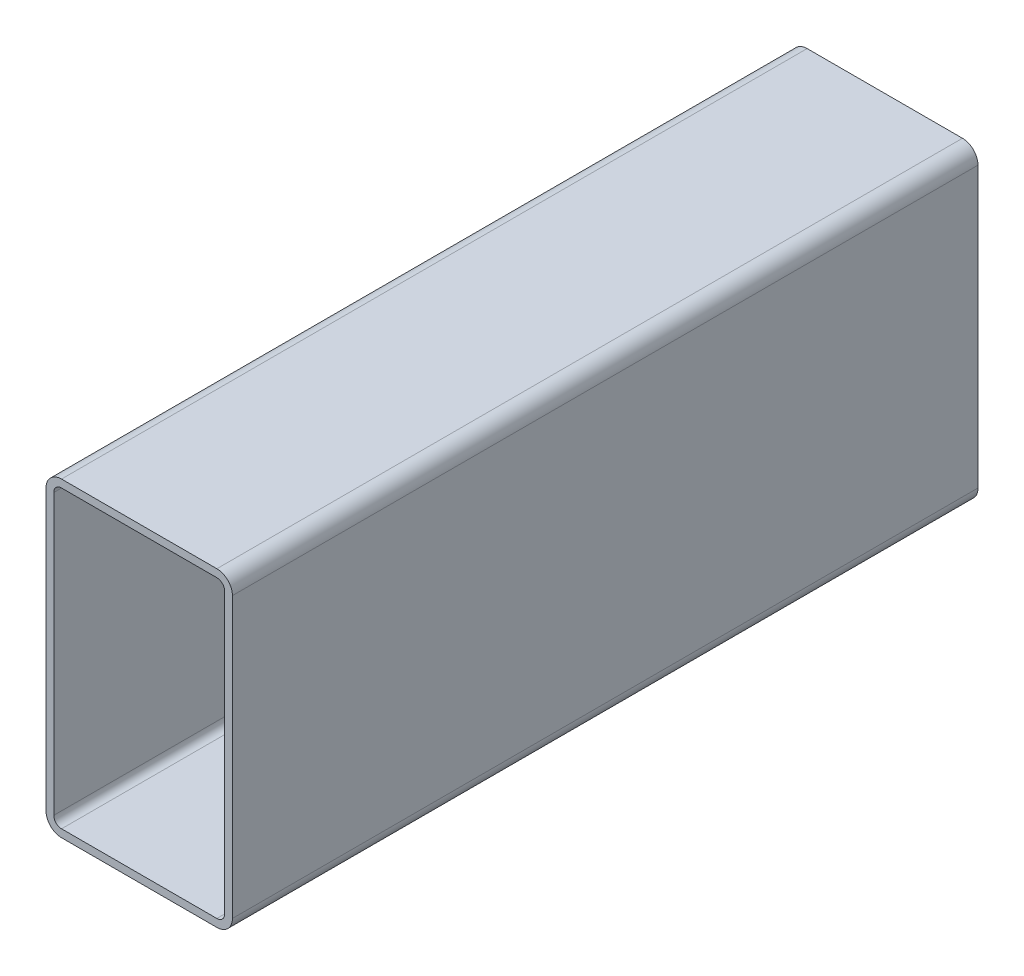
ISO-10303-21;
HEADER;
FILE_DESCRIPTION(('STEP AP214'),'2;1');
FILE_NAME('part.step','',(''),(''),'','','');
FILE_SCHEMA(('AUTOMOTIVE_DESIGN { 1 0 10303 214 1 1 1 1 }'));
ENDSEC;
DATA;
#1=APPLICATION_CONTEXT('core data for automotive mechanical design processes');
#2=APPLICATION_PROTOCOL_DEFINITION('international standard','automotive_design',2000,#1);
#3=PRODUCT_CONTEXT('',#1,'mechanical');
#4=PRODUCT('Part','Part','',(#3));
#5=PRODUCT_RELATED_PRODUCT_CATEGORY('part','',(#4));
#6=PRODUCT_DEFINITION_FORMATION('','',#4);
#7=PRODUCT_DEFINITION_CONTEXT('part definition',#1,'design');
#8=PRODUCT_DEFINITION('design','',#6,#7);
#9=PRODUCT_DEFINITION_SHAPE('','',#8);
#10=(LENGTH_UNIT() NAMED_UNIT(*) SI_UNIT(.MILLI.,.METRE.));
#11=(NAMED_UNIT(*) PLANE_ANGLE_UNIT() SI_UNIT($,.RADIAN.));
#12=(NAMED_UNIT(*) SI_UNIT($,.STERADIAN.) SOLID_ANGLE_UNIT());
#13=UNCERTAINTY_MEASURE_WITH_UNIT(LENGTH_MEASURE(1.E-05),#10,'distance_accuracy_value','');
#14=(GEOMETRIC_REPRESENTATION_CONTEXT(3) GLOBAL_UNCERTAINTY_ASSIGNED_CONTEXT((#13)) GLOBAL_UNIT_ASSIGNED_CONTEXT((#10,
#11,#12)) REPRESENTATION_CONTEXT('',''));
#15=CARTESIAN_POINT('',(0.,0.,0.));
#16=DIRECTION('',(0.,0.,1.));
#17=DIRECTION('',(1.,0.,0.));
#18=AXIS2_PLACEMENT_3D('',#15,#16,#17);
#19=CARTESIAN_POINT('',(8.83911603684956,122.684856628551,304.8));
#20=DIRECTION('',(0.,0.,1.));
#21=DIRECTION('',(1.,0.,0.));
#22=AXIS2_PLACEMENT_3D('',#19,#20,#21);
#23=PLANE('',#22);
#24=CARTESIAN_POINT('',(8.83911603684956,122.684856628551,304.8));
#25=DIRECTION('',(0.,0.,1.));
#26=DIRECTION('',(1.,0.,0.));
#27=AXIS2_PLACEMENT_3D('',#24,#25,#26);
#28=CIRCLE('',#27,6.35000000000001);
#29=CARTESIAN_POINT('',(8.83911603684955,129.034856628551,304.8));
#30=VERTEX_POINT('',#29);
#31=CARTESIAN_POINT('',(2.48911603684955,122.684856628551,304.8));
#32=VERTEX_POINT('',#31);
#33=EDGE_CURVE('E211',#30,#32,#28,.T.);
#34=ORIENTED_EDGE('',*,*,#33,.T.);
#35=DIRECTION('',(0.,-1.,0.));
#36=VECTOR('',#35,1.);
#37=CARTESIAN_POINT('',(2.48911603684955,8.38485662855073,304.8));
#38=LINE('',#37,#36);
#39=CARTESIAN_POINT('',(2.48911603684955,8.38485662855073,304.8));
#40=VERTEX_POINT('',#39);
#41=EDGE_CURVE('E214',#32,#40,#38,.T.);
#42=ORIENTED_EDGE('',*,*,#41,.T.);
#43=CARTESIAN_POINT('',(8.83911603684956,8.38485662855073,304.8));
#44=DIRECTION('',(0.,0.,1.));
#45=DIRECTION('',(1.,0.,0.));
#46=AXIS2_PLACEMENT_3D('',#43,#44,#45);
#47=CIRCLE('',#46,6.35);
#48=CARTESIAN_POINT('',(8.83911603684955,2.03485662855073,304.8));
#49=VERTEX_POINT('',#48);
#50=EDGE_CURVE('E217',#40,#49,#47,.T.);
#51=ORIENTED_EDGE('',*,*,#50,.T.);
#52=DIRECTION('',(1.,0.,0.));
#53=VECTOR('',#52,1.);
#54=CARTESIAN_POINT('',(72.3391160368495,2.03485662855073,304.8));
#55=LINE('',#54,#53);
#56=CARTESIAN_POINT('',(72.3391160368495,2.03485662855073,304.8));
#57=VERTEX_POINT('',#56);
#58=EDGE_CURVE('E219',#49,#57,#55,.T.);
#59=ORIENTED_EDGE('',*,*,#58,.T.);
#60=CARTESIAN_POINT('',(72.3391160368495,8.38485662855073,304.8));
#61=DIRECTION('',(0.,0.,1.));
#62=DIRECTION('',(1.,0.,0.));
#63=AXIS2_PLACEMENT_3D('',#60,#61,#62);
#64=CIRCLE('',#63,6.35);
#65=CARTESIAN_POINT('',(78.6891160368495,8.38485662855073,304.8));
#66=VERTEX_POINT('',#65);
#67=EDGE_CURVE('E221',#57,#66,#64,.T.);
#68=ORIENTED_EDGE('',*,*,#67,.T.);
#69=DIRECTION('',(0.,1.,0.));
#70=VECTOR('',#69,1.);
#71=CARTESIAN_POINT('',(78.6891160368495,122.684856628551,304.8));
#72=LINE('',#71,#70);
#73=CARTESIAN_POINT('',(78.6891160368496,122.684856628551,304.8));
#74=VERTEX_POINT('',#73);
#75=EDGE_CURVE('E223',#66,#74,#72,.T.);
#76=ORIENTED_EDGE('',*,*,#75,.T.);
#77=CARTESIAN_POINT('',(72.3391160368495,122.684856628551,304.8));
#78=DIRECTION('',(0.,0.,1.));
#79=DIRECTION('',(1.,0.,0.));
#80=AXIS2_PLACEMENT_3D('',#77,#78,#79);
#81=CIRCLE('',#80,6.35000000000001);
#82=CARTESIAN_POINT('',(72.3391160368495,129.034856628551,304.8));
#83=VERTEX_POINT('',#82);
#84=EDGE_CURVE('E225',#74,#83,#81,.T.);
#85=ORIENTED_EDGE('',*,*,#84,.T.);
#86=DIRECTION('',(-1.,0.,0.));
#87=VECTOR('',#86,1.);
#88=CARTESIAN_POINT('',(8.83911603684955,129.034856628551,304.8));
#89=LINE('',#88,#87);
#90=EDGE_CURVE('E227',#83,#30,#89,.T.);
#91=ORIENTED_EDGE('',*,*,#90,.T.);
#92=EDGE_LOOP('',(#34,#42,#51,#59,#68,#76,#85,#91));
#93=FACE_BOUND('',#92,.T.);
#94=DIRECTION('',(0.,-1.,0.));
#95=VECTOR('',#94,1.);
#96=CARTESIAN_POINT('',(5.66411603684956,8.38485662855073,304.8));
#97=LINE('',#96,#95);
#98=CARTESIAN_POINT('',(5.66411603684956,122.684856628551,304.8));
#99=VERTEX_POINT('',#98);
#100=CARTESIAN_POINT('',(5.66411603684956,8.38485662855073,304.8));
#101=VERTEX_POINT('',#100);
#102=EDGE_CURVE('E154',#99,#101,#97,.T.);
#103=ORIENTED_EDGE('',*,*,#102,.F.);
#104=CARTESIAN_POINT('',(8.83911603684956,122.684856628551,304.8));
#105=DIRECTION('',(0.,0.,1.));
#106=DIRECTION('',(1.,0.,0.));
#107=AXIS2_PLACEMENT_3D('',#104,#105,#106);
#108=CIRCLE('',#107,3.17500000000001);
#109=CARTESIAN_POINT('',(8.83911603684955,125.859856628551,304.8));
#110=VERTEX_POINT('',#109);
#111=EDGE_CURVE('E146',#110,#99,#108,.T.);
#112=ORIENTED_EDGE('',*,*,#111,.F.);
#113=DIRECTION('',(-1.,0.,0.));
#114=VECTOR('',#113,1.);
#115=CARTESIAN_POINT('',(8.83911603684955,125.859856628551,304.8));
#116=LINE('',#115,#114);
#117=CARTESIAN_POINT('',(72.3391160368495,125.859856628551,304.8));
#118=VERTEX_POINT('',#117);
#119=EDGE_CURVE('E179',#118,#110,#116,.T.);
#120=ORIENTED_EDGE('',*,*,#119,.F.);
#121=CARTESIAN_POINT('',(72.3391160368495,122.684856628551,304.8));
#122=DIRECTION('',(0.,0.,1.));
#123=DIRECTION('',(1.,0.,0.));
#124=AXIS2_PLACEMENT_3D('',#121,#122,#123);
#125=CIRCLE('',#124,3.17500000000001);
#126=CARTESIAN_POINT('',(75.5141160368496,122.684856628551,304.8));
#127=VERTEX_POINT('',#126);
#128=EDGE_CURVE('E177',#127,#118,#125,.T.);
#129=ORIENTED_EDGE('',*,*,#128,.F.);
#130=DIRECTION('',(0.,1.,0.));
#131=VECTOR('',#130,1.);
#132=CARTESIAN_POINT('',(75.5141160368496,122.684856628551,304.8));
#133=LINE('',#132,#131);
#134=CARTESIAN_POINT('',(75.5141160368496,8.38485662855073,304.8));
#135=VERTEX_POINT('',#134);
#136=EDGE_CURVE('E175',#135,#127,#133,.T.);
#137=ORIENTED_EDGE('',*,*,#136,.F.);
#138=CARTESIAN_POINT('',(72.3391160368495,8.38485662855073,304.8));
#139=DIRECTION('',(0.,0.,1.));
#140=DIRECTION('',(1.,0.,0.));
#141=AXIS2_PLACEMENT_3D('',#138,#139,#140);
#142=CIRCLE('',#141,3.175);
#143=CARTESIAN_POINT('',(72.3391160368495,5.20985662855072,304.8));
#144=VERTEX_POINT('',#143);
#145=EDGE_CURVE('E173',#144,#135,#142,.T.);
#146=ORIENTED_EDGE('',*,*,#145,.F.);
#147=DIRECTION('',(1.,0.,0.));
#148=VECTOR('',#147,1.);
#149=CARTESIAN_POINT('',(72.3391160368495,5.20985662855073,304.8));
#150=LINE('',#149,#148);
#151=CARTESIAN_POINT('',(8.83911603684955,5.20985662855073,304.8));
#152=VERTEX_POINT('',#151);
#153=EDGE_CURVE('E169',#152,#144,#150,.T.);
#154=ORIENTED_EDGE('',*,*,#153,.F.);
#155=CARTESIAN_POINT('',(8.83911603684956,8.38485662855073,304.8));
#156=DIRECTION('',(0.,0.,1.));
#157=DIRECTION('',(1.,0.,0.));
#158=AXIS2_PLACEMENT_3D('',#155,#156,#157);
#159=CIRCLE('',#158,3.175);
#160=EDGE_CURVE('E167',#101,#152,#159,.T.);
#161=ORIENTED_EDGE('',*,*,#160,.F.);
#162=EDGE_LOOP('',(#103,#112,#120,#129,#137,#146,#154,#161));
#163=FACE_BOUND('',#162,.T.);
#164=ADVANCED_FACE('F33',(#93,#163),#23,.T.);
#165=CARTESIAN_POINT('',(8.83911603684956,122.684856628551,0.));
#166=DIRECTION('',(0.,0.,1.));
#167=DIRECTION('',(1.,0.,0.));
#168=AXIS2_PLACEMENT_3D('',#165,#166,#167);
#169=PLANE('',#168);
#170=CARTESIAN_POINT('',(8.83911603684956,122.684856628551,0.));
#171=DIRECTION('',(0.,0.,1.));
#172=DIRECTION('',(1.,0.,0.));
#173=AXIS2_PLACEMENT_3D('',#170,#171,#172);
#174=CIRCLE('',#173,6.35000000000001);
#175=CARTESIAN_POINT('',(8.83911603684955,129.034856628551,0.));
#176=VERTEX_POINT('',#175);
#177=CARTESIAN_POINT('',(2.48911603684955,122.684856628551,0.));
#178=VERTEX_POINT('',#177);
#179=EDGE_CURVE('E162',#176,#178,#174,.T.);
#180=ORIENTED_EDGE('',*,*,#179,.F.);
#181=DIRECTION('',(-1.,0.,0.));
#182=VECTOR('',#181,1.);
#183=CARTESIAN_POINT('',(8.83911603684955,129.034856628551,0.));
#184=LINE('',#183,#182);
#185=CARTESIAN_POINT('',(72.3391160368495,129.034856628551,0.));
#186=VERTEX_POINT('',#185);
#187=EDGE_CURVE('E215',#186,#176,#184,.T.);
#188=ORIENTED_EDGE('',*,*,#187,.F.);
#189=CARTESIAN_POINT('',(72.3391160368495,122.684856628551,0.));
#190=DIRECTION('',(0.,0.,1.));
#191=DIRECTION('',(1.,0.,0.));
#192=AXIS2_PLACEMENT_3D('',#189,#190,#191);
#193=CIRCLE('',#192,6.35000000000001);
#194=CARTESIAN_POINT('',(78.6891160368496,122.684856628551,0.));
#195=VERTEX_POINT('',#194);
#196=EDGE_CURVE('E242',#195,#186,#193,.T.);
#197=ORIENTED_EDGE('',*,*,#196,.F.);
#198=DIRECTION('',(0.,1.,0.));
#199=VECTOR('',#198,1.);
#200=CARTESIAN_POINT('',(78.6891160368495,122.684856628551,0.));
#201=LINE('',#200,#199);
#202=CARTESIAN_POINT('',(78.6891160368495,8.38485662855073,0.));
#203=VERTEX_POINT('',#202);
#204=EDGE_CURVE('E240',#203,#195,#201,.T.);
#205=ORIENTED_EDGE('',*,*,#204,.F.);
#206=CARTESIAN_POINT('',(72.3391160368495,8.38485662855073,0.));
#207=DIRECTION('',(0.,0.,1.));
#208=DIRECTION('',(1.,0.,0.));
#209=AXIS2_PLACEMENT_3D('',#206,#207,#208);
#210=CIRCLE('',#209,6.35);
#211=CARTESIAN_POINT('',(72.3391160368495,2.03485662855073,0.));
#212=VERTEX_POINT('',#211);
#213=EDGE_CURVE('E238',#212,#203,#210,.T.);
#214=ORIENTED_EDGE('',*,*,#213,.F.);
#215=DIRECTION('',(1.,0.,0.));
#216=VECTOR('',#215,1.);
#217=CARTESIAN_POINT('',(72.3391160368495,2.03485662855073,0.));
#218=LINE('',#217,#216);
#219=CARTESIAN_POINT('',(8.83911603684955,2.03485662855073,0.));
#220=VERTEX_POINT('',#219);
#221=EDGE_CURVE('E236',#220,#212,#218,.T.);
#222=ORIENTED_EDGE('',*,*,#221,.F.);
#223=CARTESIAN_POINT('',(8.83911603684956,8.38485662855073,0.));
#224=DIRECTION('',(0.,0.,1.));
#225=DIRECTION('',(1.,0.,0.));
#226=AXIS2_PLACEMENT_3D('',#223,#224,#225);
#227=CIRCLE('',#226,6.35);
#228=CARTESIAN_POINT('',(2.48911603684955,8.38485662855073,0.));
#229=VERTEX_POINT('',#228);
#230=EDGE_CURVE('E234',#229,#220,#227,.T.);
#231=ORIENTED_EDGE('',*,*,#230,.F.);
#232=DIRECTION('',(0.,-1.,0.));
#233=VECTOR('',#232,1.);
#234=CARTESIAN_POINT('',(2.48911603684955,8.38485662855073,0.));
#235=LINE('',#234,#233);
#236=EDGE_CURVE('E232',#178,#229,#235,.T.);
#237=ORIENTED_EDGE('',*,*,#236,.F.);
#238=EDGE_LOOP('',(#180,#188,#197,#205,#214,#222,#231,#237));
#239=FACE_BOUND('',#238,.T.);
#240=CARTESIAN_POINT('',(8.83911603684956,122.684856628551,0.));
#241=DIRECTION('',(0.,0.,1.));
#242=DIRECTION('',(1.,0.,0.));
#243=AXIS2_PLACEMENT_3D('',#240,#241,#242);
#244=CIRCLE('',#243,3.17500000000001);
#245=CARTESIAN_POINT('',(8.83911603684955,125.859856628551,0.));
#246=VERTEX_POINT('',#245);
#247=CARTESIAN_POINT('',(5.66411603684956,122.684856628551,0.));
#248=VERTEX_POINT('',#247);
#249=EDGE_CURVE('E56',#246,#248,#244,.T.);
#250=ORIENTED_EDGE('',*,*,#249,.T.);
#251=DIRECTION('',(0.,-1.,0.));
#252=VECTOR('',#251,1.);
#253=CARTESIAN_POINT('',(5.66411603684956,8.38485662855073,0.));
#254=LINE('',#253,#252);
#255=CARTESIAN_POINT('',(5.66411603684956,8.38485662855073,0.));
#256=VERTEX_POINT('',#255);
#257=EDGE_CURVE('E161',#248,#256,#254,.T.);
#258=ORIENTED_EDGE('',*,*,#257,.T.);
#259=CARTESIAN_POINT('',(8.83911603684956,8.38485662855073,0.));
#260=DIRECTION('',(0.,0.,1.));
#261=DIRECTION('',(1.,0.,0.));
#262=AXIS2_PLACEMENT_3D('',#259,#260,#261);
#263=CIRCLE('',#262,3.175);
#264=CARTESIAN_POINT('',(8.83911603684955,5.20985662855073,0.));
#265=VERTEX_POINT('',#264);
#266=EDGE_CURVE('E183',#256,#265,#263,.T.);
#267=ORIENTED_EDGE('',*,*,#266,.T.);
#268=DIRECTION('',(1.,0.,0.));
#269=VECTOR('',#268,1.);
#270=CARTESIAN_POINT('',(72.3391160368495,5.20985662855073,0.));
#271=LINE('',#270,#269);
#272=CARTESIAN_POINT('',(72.3391160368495,5.20985662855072,0.));
#273=VERTEX_POINT('',#272);
#274=EDGE_CURVE('E186',#265,#273,#271,.T.);
#275=ORIENTED_EDGE('',*,*,#274,.T.);
#276=CARTESIAN_POINT('',(72.3391160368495,8.38485662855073,0.));
#277=DIRECTION('',(0.,0.,1.));
#278=DIRECTION('',(1.,0.,0.));
#279=AXIS2_PLACEMENT_3D('',#276,#277,#278);
#280=CIRCLE('',#279,3.175);
#281=CARTESIAN_POINT('',(75.5141160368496,8.38485662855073,0.));
#282=VERTEX_POINT('',#281);
#283=EDGE_CURVE('E189',#273,#282,#280,.T.);
#284=ORIENTED_EDGE('',*,*,#283,.T.);
#285=DIRECTION('',(0.,1.,0.));
#286=VECTOR('',#285,1.);
#287=CARTESIAN_POINT('',(75.5141160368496,122.684856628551,0.));
#288=LINE('',#287,#286);
#289=CARTESIAN_POINT('',(75.5141160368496,122.684856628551,0.));
#290=VERTEX_POINT('',#289);
#291=EDGE_CURVE('E192',#282,#290,#288,.T.);
#292=ORIENTED_EDGE('',*,*,#291,.T.);
#293=CARTESIAN_POINT('',(72.3391160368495,122.684856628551,0.));
#294=DIRECTION('',(0.,0.,1.));
#295=DIRECTION('',(1.,0.,0.));
#296=AXIS2_PLACEMENT_3D('',#293,#294,#295);
#297=CIRCLE('',#296,3.17500000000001);
#298=CARTESIAN_POINT('',(72.3391160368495,125.859856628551,0.));
#299=VERTEX_POINT('',#298);
#300=EDGE_CURVE('E195',#290,#299,#297,.T.);
#301=ORIENTED_EDGE('',*,*,#300,.T.);
#302=DIRECTION('',(-1.,0.,0.));
#303=VECTOR('',#302,1.);
#304=CARTESIAN_POINT('',(8.83911603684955,125.859856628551,0.));
#305=LINE('',#304,#303);
#306=EDGE_CURVE('E155',#299,#246,#305,.T.);
#307=ORIENTED_EDGE('',*,*,#306,.T.);
#308=EDGE_LOOP('',(#250,#258,#267,#275,#284,#292,#301,#307));
#309=FACE_BOUND('',#308,.T.);
#310=ADVANCED_FACE('F272',(#239,#309),#169,.F.);
#311=CARTESIAN_POINT('',(8.83911603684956,122.684856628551,304.8));
#312=DIRECTION('',(0.,0.,-1.));
#313=DIRECTION('',(-1.,0.,0.));
#314=AXIS2_PLACEMENT_3D('',#311,#312,#313);
#315=CYLINDRICAL_SURFACE('',#314,6.35000000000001);
#316=ORIENTED_EDGE('',*,*,#179,.T.);
#317=DIRECTION('',(0.,0.,-1.));
#318=VECTOR('',#317,1.);
#319=CARTESIAN_POINT('',(2.48911603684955,122.684856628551,304.8));
#320=LINE('',#319,#318);
#321=EDGE_CURVE('E11',#32,#178,#320,.T.);
#322=ORIENTED_EDGE('',*,*,#321,.F.);
#323=ORIENTED_EDGE('',*,*,#33,.F.);
#324=DIRECTION('',(0.,0.,-1.));
#325=VECTOR('',#324,1.);
#326=CARTESIAN_POINT('',(8.83911603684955,129.034856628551,304.8));
#327=LINE('',#326,#325);
#328=EDGE_CURVE('E229',#30,#176,#327,.T.);
#329=ORIENTED_EDGE('',*,*,#328,.T.);
#330=EDGE_LOOP('',(#316,#322,#323,#329));
#331=FACE_BOUND('',#330,.T.);
#332=ADVANCED_FACE('F35',(#331),#315,.T.);
#333=CARTESIAN_POINT('',(2.48911603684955,8.38485662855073,304.8));
#334=DIRECTION('',(1.,0.,0.));
#335=DIRECTION('',(0.,0.,-1.));
#336=AXIS2_PLACEMENT_3D('',#333,#334,#335);
#337=PLANE('',#336);
#338=ORIENTED_EDGE('',*,*,#236,.T.);
#339=DIRECTION('',(0.,0.,-1.));
#340=VECTOR('',#339,1.);
#341=CARTESIAN_POINT('',(2.48911603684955,8.38485662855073,304.8));
#342=LINE('',#341,#340);
#343=EDGE_CURVE('E41',#40,#229,#342,.T.);
#344=ORIENTED_EDGE('',*,*,#343,.F.);
#345=ORIENTED_EDGE('',*,*,#41,.F.);
#346=ORIENTED_EDGE('',*,*,#321,.T.);
#347=EDGE_LOOP('',(#338,#344,#345,#346));
#348=FACE_BOUND('',#347,.T.);
#349=ADVANCED_FACE('F289',(#348),#337,.F.);
#350=CARTESIAN_POINT('',(8.83911603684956,8.38485662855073,304.8));
#351=DIRECTION('',(0.,0.,-1.));
#352=DIRECTION('',(-1.,0.,0.));
#353=AXIS2_PLACEMENT_3D('',#350,#351,#352);
#354=CYLINDRICAL_SURFACE('',#353,6.35);
#355=ORIENTED_EDGE('',*,*,#230,.T.);
#356=DIRECTION('',(0.,0.,-1.));
#357=VECTOR('',#356,1.);
#358=CARTESIAN_POINT('',(8.83911603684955,2.03485662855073,304.8));
#359=LINE('',#358,#357);
#360=EDGE_CURVE('E259',#49,#220,#359,.T.);
#361=ORIENTED_EDGE('',*,*,#360,.F.);
#362=ORIENTED_EDGE('',*,*,#50,.F.);
#363=ORIENTED_EDGE('',*,*,#343,.T.);
#364=EDGE_LOOP('',(#355,#361,#362,#363));
#365=FACE_BOUND('',#364,.T.);
#366=ADVANCED_FACE('F266',(#365),#354,.T.);
#367=CARTESIAN_POINT('',(72.3391160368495,2.03485662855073,304.8));
#368=DIRECTION('',(0.,1.,0.));
#369=DIRECTION('',(0.,0.,1.));
#370=AXIS2_PLACEMENT_3D('',#367,#368,#369);
#371=PLANE('',#370);
#372=ORIENTED_EDGE('',*,*,#221,.T.);
#373=DIRECTION('',(0.,0.,-1.));
#374=VECTOR('',#373,1.);
#375=CARTESIAN_POINT('',(72.3391160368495,2.03485662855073,304.8));
#376=LINE('',#375,#374);
#377=EDGE_CURVE('E256',#57,#212,#376,.T.);
#378=ORIENTED_EDGE('',*,*,#377,.F.);
#379=ORIENTED_EDGE('',*,*,#58,.F.);
#380=ORIENTED_EDGE('',*,*,#360,.T.);
#381=EDGE_LOOP('',(#372,#378,#379,#380));
#382=FACE_BOUND('',#381,.T.);
#383=ADVANCED_FACE('F278',(#382),#371,.F.);
#384=CARTESIAN_POINT('',(72.3391160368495,8.38485662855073,304.8));
#385=DIRECTION('',(0.,0.,-1.));
#386=DIRECTION('',(-1.,0.,0.));
#387=AXIS2_PLACEMENT_3D('',#384,#385,#386);
#388=CYLINDRICAL_SURFACE('',#387,6.35);
#389=ORIENTED_EDGE('',*,*,#213,.T.);
#390=DIRECTION('',(0.,0.,-1.));
#391=VECTOR('',#390,1.);
#392=CARTESIAN_POINT('',(78.6891160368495,8.38485662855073,304.8));
#393=LINE('',#392,#391);
#394=EDGE_CURVE('E253',#66,#203,#393,.T.);
#395=ORIENTED_EDGE('',*,*,#394,.F.);
#396=ORIENTED_EDGE('',*,*,#67,.F.);
#397=ORIENTED_EDGE('',*,*,#377,.T.);
#398=EDGE_LOOP('',(#389,#395,#396,#397));
#399=FACE_BOUND('',#398,.T.);
#400=ADVANCED_FACE('F282',(#399),#388,.T.);
#401=CARTESIAN_POINT('',(78.6891160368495,122.684856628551,304.8));
#402=DIRECTION('',(-1.,0.,0.));
#403=DIRECTION('',(0.,0.,1.));
#404=AXIS2_PLACEMENT_3D('',#401,#402,#403);
#405=PLANE('',#404);
#406=ORIENTED_EDGE('',*,*,#204,.T.);
#407=DIRECTION('',(0.,0.,-1.));
#408=VECTOR('',#407,1.);
#409=CARTESIAN_POINT('',(78.6891160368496,122.684856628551,304.8));
#410=LINE('',#409,#408);
#411=EDGE_CURVE('E250',#74,#195,#410,.T.);
#412=ORIENTED_EDGE('',*,*,#411,.F.);
#413=ORIENTED_EDGE('',*,*,#75,.F.);
#414=ORIENTED_EDGE('',*,*,#394,.T.);
#415=EDGE_LOOP('',(#406,#412,#413,#414));
#416=FACE_BOUND('',#415,.T.);
#417=ADVANCED_FACE('F302',(#416),#405,.F.);
#418=CARTESIAN_POINT('',(72.3391160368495,122.684856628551,304.8));
#419=DIRECTION('',(0.,0.,-1.));
#420=DIRECTION('',(-1.,0.,0.));
#421=AXIS2_PLACEMENT_3D('',#418,#419,#420);
#422=CYLINDRICAL_SURFACE('',#421,6.35000000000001);
#423=ORIENTED_EDGE('',*,*,#196,.T.);
#424=DIRECTION('',(0.,0.,-1.));
#425=VECTOR('',#424,1.);
#426=CARTESIAN_POINT('',(72.3391160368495,129.034856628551,304.8));
#427=LINE('',#426,#425);
#428=EDGE_CURVE('E247',#83,#186,#427,.T.);
#429=ORIENTED_EDGE('',*,*,#428,.F.);
#430=ORIENTED_EDGE('',*,*,#84,.F.);
#431=ORIENTED_EDGE('',*,*,#411,.T.);
#432=EDGE_LOOP('',(#423,#429,#430,#431));
#433=FACE_BOUND('',#432,.T.);
#434=ADVANCED_FACE('F300',(#433),#422,.T.);
#435=CARTESIAN_POINT('',(8.83911603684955,129.034856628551,304.8));
#436=DIRECTION('',(0.,-1.,0.));
#437=DIRECTION('',(0.,0.,-1.));
#438=AXIS2_PLACEMENT_3D('',#435,#436,#437);
#439=PLANE('',#438);
#440=ORIENTED_EDGE('',*,*,#187,.T.);
#441=ORIENTED_EDGE('',*,*,#328,.F.);
#442=ORIENTED_EDGE('',*,*,#90,.F.);
#443=ORIENTED_EDGE('',*,*,#428,.T.);
#444=EDGE_LOOP('',(#440,#441,#442,#443));
#445=FACE_BOUND('',#444,.T.);
#446=ADVANCED_FACE('F295',(#445),#439,.F.);
#447=CARTESIAN_POINT('',(8.83911603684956,122.684856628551,304.8));
#448=DIRECTION('',(0.,0.,-1.));
#449=DIRECTION('',(-1.,0.,0.));
#450=AXIS2_PLACEMENT_3D('',#447,#448,#449);
#451=CYLINDRICAL_SURFACE('',#450,3.17500000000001);
#452=ORIENTED_EDGE('',*,*,#249,.F.);
#453=DIRECTION('',(0.,0.,-1.));
#454=VECTOR('',#453,1.);
#455=CARTESIAN_POINT('',(8.83911603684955,125.859856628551,304.8));
#456=LINE('',#455,#454);
#457=EDGE_CURVE('E150',#110,#246,#456,.T.);
#458=ORIENTED_EDGE('',*,*,#457,.F.);
#459=ORIENTED_EDGE('',*,*,#111,.T.);
#460=DIRECTION('',(0.,0.,-1.));
#461=VECTOR('',#460,1.);
#462=CARTESIAN_POINT('',(5.66411603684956,122.684856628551,304.8));
#463=LINE('',#462,#461);
#464=EDGE_CURVE('E149',#99,#248,#463,.T.);
#465=ORIENTED_EDGE('',*,*,#464,.T.);
#466=EDGE_LOOP('',(#452,#458,#459,#465));
#467=FACE_BOUND('',#466,.T.);
#468=ADVANCED_FACE('F148',(#467),#451,.F.);
#469=CARTESIAN_POINT('',(5.66411603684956,8.38485662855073,304.8));
#470=DIRECTION('',(1.,0.,0.));
#471=DIRECTION('',(0.,0.,-1.));
#472=AXIS2_PLACEMENT_3D('',#469,#470,#471);
#473=PLANE('',#472);
#474=ORIENTED_EDGE('',*,*,#257,.F.);
#475=ORIENTED_EDGE('',*,*,#464,.F.);
#476=ORIENTED_EDGE('',*,*,#102,.T.);
#477=DIRECTION('',(0.,0.,-1.));
#478=VECTOR('',#477,1.);
#479=CARTESIAN_POINT('',(5.66411603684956,8.38485662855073,304.8));
#480=LINE('',#479,#478);
#481=EDGE_CURVE('E163',#101,#256,#480,.T.);
#482=ORIENTED_EDGE('',*,*,#481,.T.);
#483=EDGE_LOOP('',(#474,#475,#476,#482));
#484=FACE_BOUND('',#483,.T.);
#485=ADVANCED_FACE('F158',(#484),#473,.T.);
#486=CARTESIAN_POINT('',(8.83911603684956,8.38485662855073,304.8));
#487=DIRECTION('',(0.,0.,-1.));
#488=DIRECTION('',(-1.,0.,0.));
#489=AXIS2_PLACEMENT_3D('',#486,#487,#488);
#490=CYLINDRICAL_SURFACE('',#489,3.175);
#491=ORIENTED_EDGE('',*,*,#266,.F.);
#492=ORIENTED_EDGE('',*,*,#481,.F.);
#493=ORIENTED_EDGE('',*,*,#160,.T.);
#494=DIRECTION('',(0.,0.,-1.));
#495=VECTOR('',#494,1.);
#496=CARTESIAN_POINT('',(8.83911603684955,5.20985662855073,304.8));
#497=LINE('',#496,#495);
#498=EDGE_CURVE('E208',#152,#265,#497,.T.);
#499=ORIENTED_EDGE('',*,*,#498,.T.);
#500=EDGE_LOOP('',(#491,#492,#493,#499));
#501=FACE_BOUND('',#500,.T.);
#502=ADVANCED_FACE('F327',(#501),#490,.F.);
#503=CARTESIAN_POINT('',(72.3391160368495,5.20985662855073,304.8));
#504=DIRECTION('',(0.,1.,0.));
#505=DIRECTION('',(0.,0.,1.));
#506=AXIS2_PLACEMENT_3D('',#503,#504,#505);
#507=PLANE('',#506);
#508=ORIENTED_EDGE('',*,*,#274,.F.);
#509=ORIENTED_EDGE('',*,*,#498,.F.);
#510=ORIENTED_EDGE('',*,*,#153,.T.);
#511=DIRECTION('',(0.,0.,-1.));
#512=VECTOR('',#511,1.);
#513=CARTESIAN_POINT('',(72.3391160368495,5.20985662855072,304.8));
#514=LINE('',#513,#512);
#515=EDGE_CURVE('E206',#144,#273,#514,.T.);
#516=ORIENTED_EDGE('',*,*,#515,.T.);
#517=EDGE_LOOP('',(#508,#509,#510,#516));
#518=FACE_BOUND('',#517,.T.);
#519=ADVANCED_FACE('F331',(#518),#507,.T.);
#520=CARTESIAN_POINT('',(72.3391160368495,8.38485662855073,304.8));
#521=DIRECTION('',(0.,0.,-1.));
#522=DIRECTION('',(-1.,0.,0.));
#523=AXIS2_PLACEMENT_3D('',#520,#521,#522);
#524=CYLINDRICAL_SURFACE('',#523,3.175);
#525=ORIENTED_EDGE('',*,*,#283,.F.);
#526=ORIENTED_EDGE('',*,*,#515,.F.);
#527=ORIENTED_EDGE('',*,*,#145,.T.);
#528=DIRECTION('',(0.,0.,-1.));
#529=VECTOR('',#528,1.);
#530=CARTESIAN_POINT('',(75.5141160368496,8.38485662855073,304.8));
#531=LINE('',#530,#529);
#532=EDGE_CURVE('E204',#135,#282,#531,.T.);
#533=ORIENTED_EDGE('',*,*,#532,.T.);
#534=EDGE_LOOP('',(#525,#526,#527,#533));
#535=FACE_BOUND('',#534,.T.);
#536=ADVANCED_FACE('F337',(#535),#524,.F.);
#537=CARTESIAN_POINT('',(75.5141160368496,122.684856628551,304.8));
#538=DIRECTION('',(-1.,0.,0.));
#539=DIRECTION('',(0.,0.,1.));
#540=AXIS2_PLACEMENT_3D('',#537,#538,#539);
#541=PLANE('',#540);
#542=ORIENTED_EDGE('',*,*,#291,.F.);
#543=ORIENTED_EDGE('',*,*,#532,.F.);
#544=ORIENTED_EDGE('',*,*,#136,.T.);
#545=DIRECTION('',(0.,0.,-1.));
#546=VECTOR('',#545,1.);
#547=CARTESIAN_POINT('',(75.5141160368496,122.684856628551,304.8));
#548=LINE('',#547,#546);
#549=EDGE_CURVE('E202',#127,#290,#548,.T.);
#550=ORIENTED_EDGE('',*,*,#549,.T.);
#551=EDGE_LOOP('',(#542,#543,#544,#550));
#552=FACE_BOUND('',#551,.T.);
#553=ADVANCED_FACE('F341',(#552),#541,.T.);
#554=CARTESIAN_POINT('',(72.3391160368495,122.684856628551,304.8));
#555=DIRECTION('',(0.,0.,-1.));
#556=DIRECTION('',(-1.,0.,0.));
#557=AXIS2_PLACEMENT_3D('',#554,#555,#556);
#558=CYLINDRICAL_SURFACE('',#557,3.17500000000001);
#559=ORIENTED_EDGE('',*,*,#300,.F.);
#560=ORIENTED_EDGE('',*,*,#549,.F.);
#561=ORIENTED_EDGE('',*,*,#128,.T.);
#562=DIRECTION('',(0.,0.,-1.));
#563=VECTOR('',#562,1.);
#564=CARTESIAN_POINT('',(72.3391160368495,125.859856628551,304.8));
#565=LINE('',#564,#563);
#566=EDGE_CURVE('E48',#118,#299,#565,.T.);
#567=ORIENTED_EDGE('',*,*,#566,.T.);
#568=EDGE_LOOP('',(#559,#560,#561,#567));
#569=FACE_BOUND('',#568,.T.);
#570=ADVANCED_FACE('F345',(#569),#558,.F.);
#571=CARTESIAN_POINT('',(8.83911603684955,125.859856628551,304.8));
#572=DIRECTION('',(0.,-1.,0.));
#573=DIRECTION('',(0.,0.,-1.));
#574=AXIS2_PLACEMENT_3D('',#571,#572,#573);
#575=PLANE('',#574);
#576=ORIENTED_EDGE('',*,*,#306,.F.);
#577=ORIENTED_EDGE('',*,*,#566,.F.);
#578=ORIENTED_EDGE('',*,*,#119,.T.);
#579=ORIENTED_EDGE('',*,*,#457,.T.);
#580=EDGE_LOOP('',(#576,#577,#578,#579));
#581=FACE_BOUND('',#580,.T.);
#582=ADVANCED_FACE('F349',(#581),#575,.T.);
#583=CLOSED_SHELL('',(#164,#310,#332,#349,#366,#383,#400,#417,#434,#446,#468,#485,#502,#519,
#536,#553,#570,#582));
#584=MANIFOLD_SOLID_BREP('B2',#583);
#585=ADVANCED_BREP_SHAPE_REPRESENTATION('',(#18,#584),#14);
#586=SHAPE_DEFINITION_REPRESENTATION(#9,#585);
ENDSEC;
END-ISO-10303-21;
